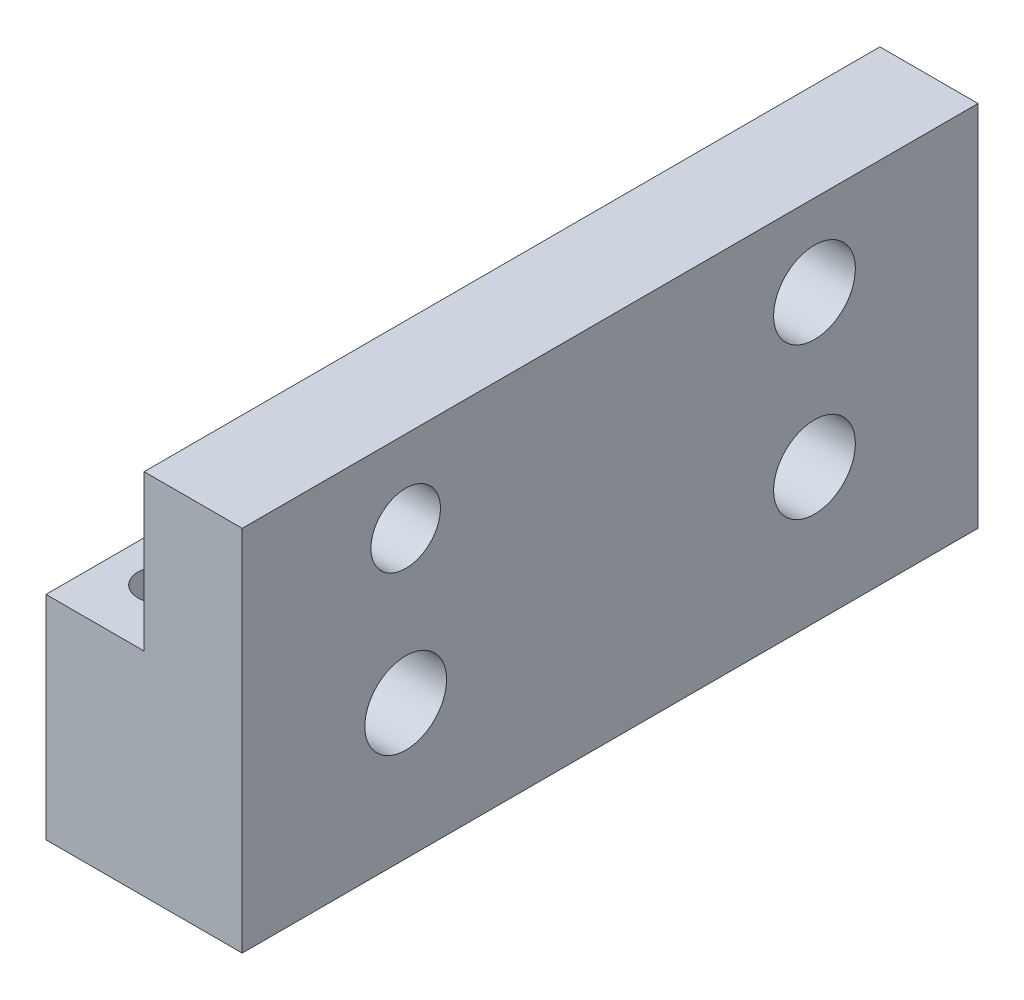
ISO-10303-21;
HEADER;
FILE_DESCRIPTION(('STEP AP214'),'2;1');
FILE_NAME('part.step','',(''),(''),'','','');
FILE_SCHEMA(('AUTOMOTIVE_DESIGN { 1 0 10303 214 1 1 1 1 }'));
ENDSEC;
DATA;
#1=APPLICATION_CONTEXT('core data for automotive mechanical design processes');
#2=APPLICATION_PROTOCOL_DEFINITION('international standard','automotive_design',2000,#1);
#3=PRODUCT_CONTEXT('',#1,'mechanical');
#4=PRODUCT('Part','Part','',(#3));
#5=PRODUCT_RELATED_PRODUCT_CATEGORY('part','',(#4));
#6=PRODUCT_DEFINITION_FORMATION('','',#4);
#7=PRODUCT_DEFINITION_CONTEXT('part definition',#1,'design');
#8=PRODUCT_DEFINITION('design','',#6,#7);
#9=PRODUCT_DEFINITION_SHAPE('','',#8);
#10=(LENGTH_UNIT() NAMED_UNIT(*) SI_UNIT(.MILLI.,.METRE.));
#11=(NAMED_UNIT(*) PLANE_ANGLE_UNIT() SI_UNIT($,.RADIAN.));
#12=(NAMED_UNIT(*) SI_UNIT($,.STERADIAN.) SOLID_ANGLE_UNIT());
#13=UNCERTAINTY_MEASURE_WITH_UNIT(LENGTH_MEASURE(1.E-05),#10,'distance_accuracy_value','');
#14=(GEOMETRIC_REPRESENTATION_CONTEXT(3) GLOBAL_UNCERTAINTY_ASSIGNED_CONTEXT((#13)) GLOBAL_UNIT_ASSIGNED_CONTEXT((#10,
#11,#12)) REPRESENTATION_CONTEXT('',''));
#15=CARTESIAN_POINT('',(0.,0.,0.));
#16=DIRECTION('',(0.,0.,1.));
#17=DIRECTION('',(1.,0.,0.));
#18=AXIS2_PLACEMENT_3D('',#15,#16,#17);
#19=CARTESIAN_POINT('',(-6.,3.5,20.));
#20=DIRECTION('',(0.,1.,0.));
#21=DIRECTION('',(0.,0.,1.));
#22=AXIS2_PLACEMENT_3D('',#19,#20,#21);
#23=CYLINDRICAL_SURFACE('',#22,1.64999999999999);
#24=CARTESIAN_POINT('',(-6.,3.5,20.));
#25=DIRECTION('',(0.,1.,0.));
#26=DIRECTION('',(0.,0.,1.));
#27=AXIS2_PLACEMENT_3D('',#24,#25,#26);
#28=CIRCLE('',#27,1.64999999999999);
#29=CARTESIAN_POINT('',(-6.,3.5,21.65));
#30=VERTEX_POINT('',#29);
#31=EDGE_CURVE('E169',#30,#30,#28,.T.);
#32=ORIENTED_EDGE('',*,*,#31,.T.);
#33=EDGE_LOOP('',(#32));
#34=FACE_BOUND('',#33,.T.);
#35=CARTESIAN_POINT('',(-4.35000000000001,-1.00000000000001,20.));
#36=CARTESIAN_POINT('',(-4.35000378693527,-1.00000272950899,20.0900197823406));
#37=CARTESIAN_POINT('',(-4.35739630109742,-1.00245575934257,20.1800846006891));
#38=CARTESIAN_POINT('',(-4.38670360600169,-1.01201043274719,20.3576091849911));
#39=CARTESIAN_POINT('',(-4.40863108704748,-1.01911613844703,20.4450666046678));
#40=CARTESIAN_POINT('',(-4.46617396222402,-1.03720026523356,20.614724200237));
#41=CARTESIAN_POINT('',(-4.50176272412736,-1.04817114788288,20.696934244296));
#42=CARTESIAN_POINT('',(-4.58551147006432,-1.07286273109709,20.8542035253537));
#43=CARTESIAN_POINT('',(-4.63367179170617,-1.08658350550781,20.9292625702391));
#44=CARTESIAN_POINT('',(-4.74291936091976,-1.1158519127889,21.0726698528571));
#45=CARTESIAN_POINT('',(-4.80435762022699,-1.13144265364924,21.1407418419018));
#46=CARTESIAN_POINT('',(-4.93768628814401,-1.16245793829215,21.2658396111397));
#47=CARTESIAN_POINT('',(-5.00958092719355,-1.17788241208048,21.3228608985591));
#48=CARTESIAN_POINT('',(-5.16426535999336,-1.20729396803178,21.4258059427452));
#49=CARTESIAN_POINT('',(-5.24730704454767,-1.22122763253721,21.4713675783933));
#50=CARTESIAN_POINT('',(-5.42035974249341,-1.24540403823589,21.5477197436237));
#51=CARTESIAN_POINT('',(-5.51036197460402,-1.25565134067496,21.5785285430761));
#52=CARTESIAN_POINT('',(-5.66730933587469,-1.2688275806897,21.6174939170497));
#53=CARTESIAN_POINT('',(-5.73317964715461,-1.27302550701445,21.6296582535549));
#54=CARTESIAN_POINT('',(-5.86602497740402,-1.27866051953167,21.6459123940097));
#55=CARTESIAN_POINT('',(-5.9329998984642,-1.28009784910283,21.6500029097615));
#56=CARTESIAN_POINT('',(-6.08986951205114,-1.28009197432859,21.6499960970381));
#57=CARTESIAN_POINT('',(-6.17978432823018,-1.27749808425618,21.6426273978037));
#58=CARTESIAN_POINT('',(-6.35699665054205,-1.26744328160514,21.6134233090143));
#59=CARTESIAN_POINT('',(-6.44429168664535,-1.25997791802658,21.5915746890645));
#60=CARTESIAN_POINT('',(-6.61360460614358,-1.24111979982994,21.5342620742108));
#61=CARTESIAN_POINT('',(-6.69563371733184,-1.22973575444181,21.4988282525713));
#62=CARTESIAN_POINT('',(-6.85259401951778,-1.20433464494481,21.4154453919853));
#63=CARTESIAN_POINT('',(-6.92752482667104,-1.19031743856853,21.3674956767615));
#64=CARTESIAN_POINT('',(-7.07105050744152,-1.1606257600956,21.2584719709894));
#65=CARTESIAN_POINT('',(-7.13933433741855,-1.14491060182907,21.1969994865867));
#66=CARTESIAN_POINT('',(-7.26484842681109,-1.11393470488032,21.0635104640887));
#67=CARTESIAN_POINT('',(-7.32207483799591,-1.0986741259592,20.9914902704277));
#68=CARTESIAN_POINT('',(-7.42525766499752,-1.06985426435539,20.8366699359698));
#69=CARTESIAN_POINT('',(-7.47088388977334,-1.05634926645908,20.7536389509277));
#70=CARTESIAN_POINT('',(-7.54735861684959,-1.03306105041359,20.5806069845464));
#71=CARTESIAN_POINT('',(-7.57822470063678,-1.02327340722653,20.4906144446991));
#72=CARTESIAN_POINT('',(-7.61733057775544,-1.01070811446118,20.3335211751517));
#73=CARTESIAN_POINT('',(-7.62955663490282,-1.00671495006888,20.2674828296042));
#74=CARTESIAN_POINT('',(-7.6458924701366,-1.0013599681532,20.1343046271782));
#75=CARTESIAN_POINT('',(-7.65000282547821,-0.999997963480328,20.0671648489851));
#76=CARTESIAN_POINT('',(-7.64999621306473,-1.00000272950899,19.9099802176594));
#77=CARTESIAN_POINT('',(-7.64260369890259,-1.00245575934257,19.8199153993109));
#78=CARTESIAN_POINT('',(-7.61329639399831,-1.01201043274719,19.6423908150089));
#79=CARTESIAN_POINT('',(-7.59136891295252,-1.01911613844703,19.5549333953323));
#80=CARTESIAN_POINT('',(-7.53382603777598,-1.03720026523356,19.385275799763));
#81=CARTESIAN_POINT('',(-7.49823727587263,-1.04817114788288,19.303065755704));
#82=CARTESIAN_POINT('',(-7.41448852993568,-1.07286273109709,19.1457964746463));
#83=CARTESIAN_POINT('',(-7.36632820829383,-1.08658350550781,19.0707374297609));
#84=CARTESIAN_POINT('',(-7.25708063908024,-1.1158519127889,18.9273301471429));
#85=CARTESIAN_POINT('',(-7.19564237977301,-1.13144265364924,18.8592581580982));
#86=CARTESIAN_POINT('',(-7.06231371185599,-1.16245793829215,18.7341603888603));
#87=CARTESIAN_POINT('',(-6.99041907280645,-1.17788241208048,18.6771391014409));
#88=CARTESIAN_POINT('',(-6.83573464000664,-1.20729396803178,18.5741940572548));
#89=CARTESIAN_POINT('',(-6.75269295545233,-1.22122763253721,18.5286324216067));
#90=CARTESIAN_POINT('',(-6.57964025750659,-1.24540403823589,18.4522802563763));
#91=CARTESIAN_POINT('',(-6.48963802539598,-1.25565134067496,18.4214714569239));
#92=CARTESIAN_POINT('',(-6.33269066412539,-1.26882758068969,18.3825060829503));
#93=CARTESIAN_POINT('',(-6.26682035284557,-1.27302550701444,18.3703417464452));
#94=CARTESIAN_POINT('',(-6.13397502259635,-1.27866051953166,18.3540876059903));
#95=CARTESIAN_POINT('',(-6.06700010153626,-1.28009784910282,18.3499970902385));
#96=CARTESIAN_POINT('',(-5.91013048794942,-1.2800919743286,18.3500039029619));
#97=CARTESIAN_POINT('',(-5.82021567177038,-1.2774980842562,18.3573726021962));
#98=CARTESIAN_POINT('',(-5.64300334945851,-1.26744328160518,18.3865766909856));
#99=CARTESIAN_POINT('',(-5.5557083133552,-1.25997791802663,18.4084253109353));
#100=CARTESIAN_POINT('',(-5.38639539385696,-1.24111979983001,18.465737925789));
#101=CARTESIAN_POINT('',(-5.30436628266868,-1.22973575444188,18.5011717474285));
#102=CARTESIAN_POINT('',(-5.14740598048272,-1.2043346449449,18.5845546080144));
#103=CARTESIAN_POINT('',(-5.07247517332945,-1.19031743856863,18.6325043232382));
#104=CARTESIAN_POINT('',(-4.92894949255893,-1.1606257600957,18.7415280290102));
#105=CARTESIAN_POINT('',(-4.86066566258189,-1.14491060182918,18.8030005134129));
#106=CARTESIAN_POINT('',(-4.7351515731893,-1.11393470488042,18.9364895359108));
#107=CARTESIAN_POINT('',(-4.67792516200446,-1.0986741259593,19.0085097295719));
#108=CARTESIAN_POINT('',(-4.5747423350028,-1.06985426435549,19.1633300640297));
#109=CARTESIAN_POINT('',(-4.52911611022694,-1.05634926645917,19.2463610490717));
#110=CARTESIAN_POINT('',(-4.45264138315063,-1.03306105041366,19.419393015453));
#111=CARTESIAN_POINT('',(-4.4217752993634,-1.02327340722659,19.5093855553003));
#112=CARTESIAN_POINT('',(-4.38266942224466,-1.01070811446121,19.6664788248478));
#113=CARTESIAN_POINT('',(-4.37044336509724,-1.0067149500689,19.7325171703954));
#114=CARTESIAN_POINT('',(-4.35410752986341,-1.0013599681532,19.8656953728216));
#115=CARTESIAN_POINT('',(-4.34999717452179,-0.999997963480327,19.9328351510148));
#116=CARTESIAN_POINT('',(-4.35000000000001,-1.00000000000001,20.));
#117=B_SPLINE_CURVE_WITH_KNOTS('',3,(#35,#36,#37,#38,#39,#40,#41,#42,#43,#44,#45,#46,#47,#48,
#49,#50,#51,#52,#53,#54,#55,#56,#57,#58,#59,#60,#61,#62,#63,#64,#65,#66,#67,#68,#69,#70,#71,#72,
#73,#74,#75,#76,#77,#78,#79,#80,#81,#82,#83,#84,#85,#86,#87,#88,#89,#90,#91,#92,#93,#94,#95,#96,
#97,#98,#99,#100,#101,#102,#103,#104,#105,#106,#107,#108,#109,#110,#111,#112,#113,#114,#115,
#116),.UNSPECIFIED.,.T.,.F.,(4,2,2,2,2,2,2,2,2,2,2,2,2,2,2,2,2,2,2,2,2,2,2,2,2,2,2,2,2,2,2,2,2,
2,2,2,2,2,2,2,4),(0.,0.269807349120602,0.539850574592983,0.809370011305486,1.07889668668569,
1.35668555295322,1.63458712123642,1.92039970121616,2.20585741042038,2.40668679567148,
2.6074984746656,2.87685400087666,3.14645597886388,3.41546259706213,3.68448375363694,
3.96286239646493,4.24133774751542,4.52702385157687,4.81236880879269,5.01368965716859,
5.21499618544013,5.48480353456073,5.75484676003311,6.02436619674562,6.29389287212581,
6.57168173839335,6.84958330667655,7.13539588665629,7.42085359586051,7.62168298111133,
7.82249466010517,8.09185018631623,8.36145216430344,8.63045878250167,8.89947993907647,
9.17785858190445,9.45633393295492,9.74202003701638,10.0273649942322,10.2286858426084,
10.4299923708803),.UNSPECIFIED.);
#118=CARTESIAN_POINT('',(-4.35000000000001,-1.00000000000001,20.));
#119=VERTEX_POINT('',#118);
#120=EDGE_CURVE('E157',#119,#119,#117,.T.);
#121=ORIENTED_EDGE('',*,*,#120,.T.);
#122=EDGE_LOOP('',(#121));
#123=FACE_BOUND('',#122,.T.);
#124=ADVANCED_FACE('F17',(#34,#123),#23,.F.);
#125=CARTESIAN_POINT('',(-6.,3.5,70.));
#126=DIRECTION('',(0.,1.,0.));
#127=DIRECTION('',(0.,0.,1.));
#128=AXIS2_PLACEMENT_3D('',#125,#126,#127);
#129=CYLINDRICAL_SURFACE('',#128,1.64999999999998);
#130=CARTESIAN_POINT('',(-6.,3.5,70.));
#131=DIRECTION('',(0.,1.,0.));
#132=DIRECTION('',(0.,0.,1.));
#133=AXIS2_PLACEMENT_3D('',#130,#131,#132);
#134=CIRCLE('',#133,1.64999999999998);
#135=CARTESIAN_POINT('',(-6.,3.5,71.65));
#136=VERTEX_POINT('',#135);
#137=EDGE_CURVE('E105',#136,#136,#134,.T.);
#138=ORIENTED_EDGE('',*,*,#137,.T.);
#139=EDGE_LOOP('',(#138));
#140=FACE_BOUND('',#139,.T.);
#141=CARTESIAN_POINT('',(-4.35000000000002,-1.,70.));
#142=CARTESIAN_POINT('',(-4.35000378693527,-1.00000272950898,70.0900197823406));
#143=CARTESIAN_POINT('',(-4.35739630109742,-1.00245575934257,70.1800846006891));
#144=CARTESIAN_POINT('',(-4.3867036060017,-1.01201043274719,70.3576091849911));
#145=CARTESIAN_POINT('',(-4.40863108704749,-1.01911613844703,70.4450666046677));
#146=CARTESIAN_POINT('',(-4.46617396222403,-1.03720026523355,70.614724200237));
#147=CARTESIAN_POINT('',(-4.50176272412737,-1.04817114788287,70.696934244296));
#148=CARTESIAN_POINT('',(-4.58551147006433,-1.07286273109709,70.8542035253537));
#149=CARTESIAN_POINT('',(-4.63367179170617,-1.08658350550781,70.9292625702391));
#150=CARTESIAN_POINT('',(-4.74291936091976,-1.1158519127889,71.0726698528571));
#151=CARTESIAN_POINT('',(-4.80435762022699,-1.13144265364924,71.1407418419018));
#152=CARTESIAN_POINT('',(-4.93768628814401,-1.16245793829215,71.2658396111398));
#153=CARTESIAN_POINT('',(-5.00958092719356,-1.17788241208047,71.3228608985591));
#154=CARTESIAN_POINT('',(-5.16426535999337,-1.20729396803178,71.4258059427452));
#155=CARTESIAN_POINT('',(-5.24730704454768,-1.22122763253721,71.4713675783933));
#156=CARTESIAN_POINT('',(-5.42035974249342,-1.24540403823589,71.5477197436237));
#157=CARTESIAN_POINT('',(-5.51036197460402,-1.25565134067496,71.5785285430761));
#158=CARTESIAN_POINT('',(-5.66730933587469,-1.2688275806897,71.6174939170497));
#159=CARTESIAN_POINT('',(-5.73317964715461,-1.27302550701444,71.6296582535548));
#160=CARTESIAN_POINT('',(-5.86602497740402,-1.27866051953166,71.6459123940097));
#161=CARTESIAN_POINT('',(-5.9329998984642,-1.28009784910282,71.6500029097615));
#162=CARTESIAN_POINT('',(-6.08986951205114,-1.28009197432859,71.649996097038));
#163=CARTESIAN_POINT('',(-6.17978432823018,-1.27749808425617,71.6426273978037));
#164=CARTESIAN_POINT('',(-6.35699665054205,-1.26744328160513,71.6134233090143));
#165=CARTESIAN_POINT('',(-6.44429168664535,-1.25997791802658,71.5915746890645));
#166=CARTESIAN_POINT('',(-6.61360460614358,-1.24111979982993,71.5342620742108));
#167=CARTESIAN_POINT('',(-6.69563371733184,-1.2297357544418,71.4988282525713));
#168=CARTESIAN_POINT('',(-6.85259401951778,-1.2043346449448,71.4154453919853));
#169=CARTESIAN_POINT('',(-6.92752482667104,-1.19031743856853,71.3674956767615));
#170=CARTESIAN_POINT('',(-7.07105050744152,-1.16062576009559,71.2584719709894));
#171=CARTESIAN_POINT('',(-7.13933433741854,-1.14491060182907,71.1969994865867));
#172=CARTESIAN_POINT('',(-7.26484842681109,-1.11393470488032,71.0635104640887));
#173=CARTESIAN_POINT('',(-7.32207483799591,-1.09867412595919,70.9914902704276));
#174=CARTESIAN_POINT('',(-7.42525766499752,-1.06985426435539,70.8366699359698));
#175=CARTESIAN_POINT('',(-7.47088388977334,-1.05634926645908,70.7536389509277));
#176=CARTESIAN_POINT('',(-7.54735861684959,-1.03306105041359,70.5806069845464));
#177=CARTESIAN_POINT('',(-7.57822470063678,-1.02327340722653,70.4906144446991));
#178=CARTESIAN_POINT('',(-7.61733057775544,-1.01070811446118,70.3335211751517));
#179=CARTESIAN_POINT('',(-7.62955663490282,-1.00671495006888,70.2674828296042));
#180=CARTESIAN_POINT('',(-7.6458924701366,-1.0013599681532,70.1343046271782));
#181=CARTESIAN_POINT('',(-7.65000282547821,-0.999997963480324,70.0671648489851));
#182=CARTESIAN_POINT('',(-7.64999621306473,-1.00000272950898,69.9099802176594));
#183=CARTESIAN_POINT('',(-7.64260369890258,-1.00245575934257,69.8199153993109));
#184=CARTESIAN_POINT('',(-7.61329639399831,-1.01201043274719,69.6423908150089));
#185=CARTESIAN_POINT('',(-7.59136891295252,-1.01911613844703,69.5549333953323));
#186=CARTESIAN_POINT('',(-7.53382603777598,-1.03720026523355,69.385275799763));
#187=CARTESIAN_POINT('',(-7.49823727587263,-1.04817114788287,69.303065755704));
#188=CARTESIAN_POINT('',(-7.41448852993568,-1.07286273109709,69.1457964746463));
#189=CARTESIAN_POINT('',(-7.36632820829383,-1.08658350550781,69.0707374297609));
#190=CARTESIAN_POINT('',(-7.25708063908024,-1.1158519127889,68.9273301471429));
#191=CARTESIAN_POINT('',(-7.19564237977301,-1.13144265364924,68.8592581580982));
#192=CARTESIAN_POINT('',(-7.06231371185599,-1.16245793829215,68.7341603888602));
#193=CARTESIAN_POINT('',(-6.99041907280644,-1.17788241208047,68.6771391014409));
#194=CARTESIAN_POINT('',(-6.83573464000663,-1.20729396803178,68.5741940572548));
#195=CARTESIAN_POINT('',(-6.75269295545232,-1.22122763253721,68.5286324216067));
#196=CARTESIAN_POINT('',(-6.57964025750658,-1.24540403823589,68.4522802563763));
#197=CARTESIAN_POINT('',(-6.48963802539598,-1.25565134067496,68.4214714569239));
#198=CARTESIAN_POINT('',(-6.3326906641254,-1.26882758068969,68.3825060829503));
#199=CARTESIAN_POINT('',(-6.26682035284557,-1.27302550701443,68.3703417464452));
#200=CARTESIAN_POINT('',(-6.13397502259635,-1.27866051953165,68.3540876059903));
#201=CARTESIAN_POINT('',(-6.06700010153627,-1.28009784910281,68.3499970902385));
#202=CARTESIAN_POINT('',(-5.91013048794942,-1.2800919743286,68.3500039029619));
#203=CARTESIAN_POINT('',(-5.82021567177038,-1.27749808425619,68.3573726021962));
#204=CARTESIAN_POINT('',(-5.64300334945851,-1.26744328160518,68.3865766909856));
#205=CARTESIAN_POINT('',(-5.5557083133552,-1.25997791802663,68.4084253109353));
#206=CARTESIAN_POINT('',(-5.38639539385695,-1.24111979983,68.465737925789));
#207=CARTESIAN_POINT('',(-5.30436628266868,-1.22973575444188,68.5011717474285));
#208=CARTESIAN_POINT('',(-5.14740598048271,-1.20433464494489,68.5845546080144));
#209=CARTESIAN_POINT('',(-5.07247517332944,-1.19031743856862,68.6325043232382));
#210=CARTESIAN_POINT('',(-4.92894949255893,-1.16062576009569,68.7415280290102));
#211=CARTESIAN_POINT('',(-4.86066566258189,-1.14491060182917,68.8030005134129));
#212=CARTESIAN_POINT('',(-4.73515157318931,-1.11393470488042,68.9364895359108));
#213=CARTESIAN_POINT('',(-4.67792516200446,-1.09867412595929,69.0085097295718));
#214=CARTESIAN_POINT('',(-4.5747423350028,-1.06985426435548,69.1633300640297));
#215=CARTESIAN_POINT('',(-4.52911611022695,-1.05634926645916,69.2463610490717));
#216=CARTESIAN_POINT('',(-4.45264138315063,-1.03306105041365,69.419393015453));
#217=CARTESIAN_POINT('',(-4.4217752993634,-1.02327340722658,69.5093855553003));
#218=CARTESIAN_POINT('',(-4.38266942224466,-1.01070811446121,69.6664788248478));
#219=CARTESIAN_POINT('',(-4.37044336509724,-1.0067149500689,69.7325171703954));
#220=CARTESIAN_POINT('',(-4.35410752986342,-1.0013599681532,69.8656953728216));
#221=CARTESIAN_POINT('',(-4.34999717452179,-0.999997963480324,69.9328351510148));
#222=CARTESIAN_POINT('',(-4.35000000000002,-1.,70.));
#223=B_SPLINE_CURVE_WITH_KNOTS('',3,(#141,#142,#143,#144,#145,#146,#147,#148,#149,#150,#151,
#152,#153,#154,#155,#156,#157,#158,#159,#160,#161,#162,#163,#164,#165,#166,#167,#168,#169,#170,
#171,#172,#173,#174,#175,#176,#177,#178,#179,#180,#181,#182,#183,#184,#185,#186,#187,#188,#189,
#190,#191,#192,#193,#194,#195,#196,#197,#198,#199,#200,#201,#202,#203,#204,#205,#206,#207,#208,
#209,#210,#211,#212,#213,#214,#215,#216,#217,#218,#219,#220,#221,#222),.UNSPECIFIED.,.T.,.F.,(4,
2,2,2,2,2,2,2,2,2,2,2,2,2,2,2,2,2,2,2,2,2,2,2,2,2,2,2,2,2,2,2,2,2,2,2,2,2,2,2,4),(0.,
0.269807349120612,0.539850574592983,0.80937001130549,1.07889668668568,1.35668555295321,
1.63458712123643,1.92039970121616,2.20585741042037,2.40668679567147,2.60749847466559,
2.87685400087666,3.14645597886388,3.41546259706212,3.68448375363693,3.96286239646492,
4.2413377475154,4.52702385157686,4.81236880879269,5.01368965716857,5.21499618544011,
5.48480353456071,5.7548467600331,6.0243661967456,6.2938928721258,6.57168173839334,
6.84958330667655,7.13539588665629,7.42085359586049,7.62168298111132,7.82249466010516,
8.09185018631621,8.36145216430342,8.63045878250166,8.89947993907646,9.17785858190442,
9.4563339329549,9.74202003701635,10.0273649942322,10.2286858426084,10.4299923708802),.UNSPECIFIED.);
#224=CARTESIAN_POINT('',(-4.35000000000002,-1.,70.));
#225=VERTEX_POINT('',#224);
#226=EDGE_CURVE('E131',#225,#225,#223,.T.);
#227=ORIENTED_EDGE('',*,*,#226,.T.);
#228=EDGE_LOOP('',(#227));
#229=FACE_BOUND('',#228,.T.);
#230=ADVANCED_FACE('F139',(#140,#229),#129,.F.);
#231=CARTESIAN_POINT('',(-5.99999999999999,-22.5,82.));
#232=DIRECTION('',(0.,1.,0.));
#233=DIRECTION('',(0.,0.,1.));
#234=AXIS2_PLACEMENT_3D('',#231,#232,#233);
#235=CYLINDRICAL_SURFACE('',#234,2.75);
#236=CARTESIAN_POINT('',(-5.99999999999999,-22.5,82.));
#237=DIRECTION('',(0.,1.,0.));
#238=DIRECTION('',(0.,0.,1.));
#239=AXIS2_PLACEMENT_3D('',#236,#237,#238);
#240=CIRCLE('',#239,2.75);
#241=CARTESIAN_POINT('',(-5.99999999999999,-22.5,84.75));
#242=VERTEX_POINT('',#241);
#243=EDGE_CURVE('E125',#242,#242,#240,.F.);
#244=ORIENTED_EDGE('',*,*,#243,.T.);
#245=EDGE_LOOP('',(#244));
#246=FACE_BOUND('',#245,.T.);
#247=CARTESIAN_POINT('',(-5.99999999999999,3.5,82.));
#248=DIRECTION('',(0.,1.,0.));
#249=DIRECTION('',(0.,0.,1.));
#250=AXIS2_PLACEMENT_3D('',#247,#248,#249);
#251=CIRCLE('',#250,2.75);
#252=CARTESIAN_POINT('',(-5.99999999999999,3.5,84.75));
#253=VERTEX_POINT('',#252);
#254=EDGE_CURVE('E21',#253,#253,#251,.T.);
#255=ORIENTED_EDGE('',*,*,#254,.T.);
#256=EDGE_LOOP('',(#255));
#257=FACE_BOUND('',#256,.T.);
#258=ADVANCED_FACE('F181',(#246,#257),#235,.F.);
#259=CARTESIAN_POINT('',(-6.,-22.5,45.));
#260=DIRECTION('',(0.,1.,0.));
#261=DIRECTION('',(0.,0.,1.));
#262=AXIS2_PLACEMENT_3D('',#259,#260,#261);
#263=CYLINDRICAL_SURFACE('',#262,2.75);
#264=CARTESIAN_POINT('',(-6.,-22.5,45.));
#265=DIRECTION('',(0.,1.,0.));
#266=DIRECTION('',(0.,0.,1.));
#267=AXIS2_PLACEMENT_3D('',#264,#265,#266);
#268=CIRCLE('',#267,2.75);
#269=CARTESIAN_POINT('',(-6.,-22.5,47.75));
#270=VERTEX_POINT('',#269);
#271=EDGE_CURVE('E122',#270,#270,#268,.F.);
#272=ORIENTED_EDGE('',*,*,#271,.T.);
#273=EDGE_LOOP('',(#272));
#274=FACE_BOUND('',#273,.T.);
#275=CARTESIAN_POINT('',(-6.,3.5,45.));
#276=DIRECTION('',(0.,1.,0.));
#277=DIRECTION('',(0.,0.,1.));
#278=AXIS2_PLACEMENT_3D('',#275,#276,#277);
#279=CIRCLE('',#278,2.75);
#280=CARTESIAN_POINT('',(-6.,3.5,47.75));
#281=VERTEX_POINT('',#280);
#282=EDGE_CURVE('E174',#281,#281,#279,.T.);
#283=ORIENTED_EDGE('',*,*,#282,.T.);
#284=EDGE_LOOP('',(#283));
#285=FACE_BOUND('',#284,.T.);
#286=ADVANCED_FACE('F227',(#274,#285),#263,.F.);
#287=CARTESIAN_POINT('',(-6.,-22.5,8.));
#288=DIRECTION('',(0.,1.,0.));
#289=DIRECTION('',(0.,0.,1.));
#290=AXIS2_PLACEMENT_3D('',#287,#288,#289);
#291=CYLINDRICAL_SURFACE('',#290,2.75);
#292=CARTESIAN_POINT('',(-6.,-22.5,8.));
#293=DIRECTION('',(0.,1.,0.));
#294=DIRECTION('',(0.,0.,1.));
#295=AXIS2_PLACEMENT_3D('',#292,#293,#294);
#296=CIRCLE('',#295,2.75);
#297=CARTESIAN_POINT('',(-6.,-22.5,10.75));
#298=VERTEX_POINT('',#297);
#299=EDGE_CURVE('E102',#298,#298,#296,.F.);
#300=ORIENTED_EDGE('',*,*,#299,.T.);
#301=EDGE_LOOP('',(#300));
#302=FACE_BOUND('',#301,.T.);
#303=CARTESIAN_POINT('',(-6.,3.5,8.));
#304=DIRECTION('',(0.,1.,0.));
#305=DIRECTION('',(0.,0.,1.));
#306=AXIS2_PLACEMENT_3D('',#303,#304,#305);
#307=CIRCLE('',#306,2.75);
#308=CARTESIAN_POINT('',(-6.,3.5,10.75));
#309=VERTEX_POINT('',#308);
#310=EDGE_CURVE('E172',#309,#309,#307,.T.);
#311=ORIENTED_EDGE('',*,*,#310,.T.);
#312=EDGE_LOOP('',(#311));
#313=FACE_BOUND('',#312,.T.);
#314=ADVANCED_FACE('F232',(#302,#313),#291,.F.);
#315=CARTESIAN_POINT('',(-12.,22.5,90.));
#316=DIRECTION('',(1.,0.,0.));
#317=DIRECTION('',(0.,1.,0.));
#318=AXIS2_PLACEMENT_3D('',#315,#316,#317);
#319=PLANE('',#318);
#320=DIRECTION('',(0.,0.,-1.));
#321=VECTOR('',#320,1.);
#322=CARTESIAN_POINT('',(-12.,3.5,0.));
#323=LINE('',#322,#321);
#324=CARTESIAN_POINT('',(-12.,3.5,90.));
#325=VERTEX_POINT('',#324);
#326=CARTESIAN_POINT('',(-12.,3.5,0.));
#327=VERTEX_POINT('',#326);
#328=EDGE_CURVE('E69',#325,#327,#323,.T.);
#329=ORIENTED_EDGE('',*,*,#328,.T.);
#330=DIRECTION('',(0.,1.,0.));
#331=VECTOR('',#330,1.);
#332=CARTESIAN_POINT('',(-12.,0.,0.));
#333=LINE('',#332,#331);
#334=CARTESIAN_POINT('',(-12.,-22.5,0.));
#335=VERTEX_POINT('',#334);
#336=EDGE_CURVE('E408',#327,#335,#333,.F.);
#337=ORIENTED_EDGE('',*,*,#336,.T.);
#338=DIRECTION('',(0.,0.,1.));
#339=VECTOR('',#338,1.);
#340=CARTESIAN_POINT('',(-12.,-22.5,90.));
#341=LINE('',#340,#339);
#342=CARTESIAN_POINT('',(-12.,-22.5,90.));
#343=VERTEX_POINT('',#342);
#344=EDGE_CURVE('E83',#335,#343,#341,.T.);
#345=ORIENTED_EDGE('',*,*,#344,.T.);
#346=DIRECTION('',(0.,1.,0.));
#347=VECTOR('',#346,1.);
#348=CARTESIAN_POINT('',(-12.,0.,90.));
#349=LINE('',#348,#347);
#350=EDGE_CURVE('E95',#325,#343,#349,.F.);
#351=ORIENTED_EDGE('',*,*,#350,.F.);
#352=EDGE_LOOP('',(#329,#337,#345,#351));
#353=FACE_BOUND('',#352,.T.);
#354=CARTESIAN_POINT('',(-12.,-6.00000000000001,70.));
#355=DIRECTION('',(1.,0.,0.));
#356=DIRECTION('',(0.,1.,0.));
#357=AXIS2_PLACEMENT_3D('',#354,#355,#356);
#358=CIRCLE('',#357,5.);
#359=CARTESIAN_POINT('',(-12.,-1.00000000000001,70.));
#360=VERTEX_POINT('',#359);
#361=EDGE_CURVE('E128',#360,#360,#358,.T.);
#362=ORIENTED_EDGE('',*,*,#361,.T.);
#363=EDGE_LOOP('',(#362));
#364=FACE_BOUND('',#363,.T.);
#365=CARTESIAN_POINT('',(-12.,-6.00000000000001,20.));
#366=DIRECTION('',(1.,0.,0.));
#367=DIRECTION('',(0.,1.,0.));
#368=AXIS2_PLACEMENT_3D('',#365,#366,#367);
#369=CIRCLE('',#368,5.);
#370=CARTESIAN_POINT('',(-12.,-1.00000000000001,20.));
#371=VERTEX_POINT('',#370);
#372=EDGE_CURVE('E137',#371,#371,#369,.T.);
#373=ORIENTED_EDGE('',*,*,#372,.T.);
#374=EDGE_LOOP('',(#373));
#375=FACE_BOUND('',#374,.T.);
#376=ADVANCED_FACE('F192',(#353,#364,#375),#319,.F.);
#377=CARTESIAN_POINT('',(0.,22.5,0.));
#378=DIRECTION('',(1.,0.,0.));
#379=DIRECTION('',(0.,1.,0.));
#380=AXIS2_PLACEMENT_3D('',#377,#378,#379);
#381=PLANE('',#380);
#382=DIRECTION('',(0.,0.,-1.));
#383=VECTOR('',#382,1.);
#384=CARTESIAN_POINT('',(0.,22.5,90.));
#385=LINE('',#384,#383);
#386=CARTESIAN_POINT('',(0.,22.5,90.));
#387=VERTEX_POINT('',#386);
#388=CARTESIAN_POINT('',(0.,22.5,0.));
#389=VERTEX_POINT('',#388);
#390=EDGE_CURVE('E418',#387,#389,#385,.T.);
#391=ORIENTED_EDGE('',*,*,#390,.T.);
#392=DIRECTION('',(0.,1.,0.));
#393=VECTOR('',#392,1.);
#394=CARTESIAN_POINT('',(0.,0.,0.));
#395=LINE('',#394,#393);
#396=CARTESIAN_POINT('',(0.,3.5,0.));
#397=VERTEX_POINT('',#396);
#398=EDGE_CURVE('E89',#389,#397,#395,.F.);
#399=ORIENTED_EDGE('',*,*,#398,.T.);
#400=DIRECTION('',(0.,0.,-1.));
#401=VECTOR('',#400,1.);
#402=CARTESIAN_POINT('',(0.,3.5,0.));
#403=LINE('',#402,#401);
#404=CARTESIAN_POINT('',(0.,3.5,90.));
#405=VERTEX_POINT('',#404);
#406=EDGE_CURVE('E86',#397,#405,#403,.F.);
#407=ORIENTED_EDGE('',*,*,#406,.T.);
#408=DIRECTION('',(0.,1.,0.));
#409=VECTOR('',#408,1.);
#410=CARTESIAN_POINT('',(0.,0.,90.));
#411=LINE('',#410,#409);
#412=EDGE_CURVE('E74',#387,#405,#411,.F.);
#413=ORIENTED_EDGE('',*,*,#412,.F.);
#414=EDGE_LOOP('',(#391,#399,#407,#413));
#415=FACE_BOUND('',#414,.T.);
#416=CARTESIAN_POINT('',(0.,12.5,20.));
#417=DIRECTION('',(-1.,0.,0.));
#418=DIRECTION('',(0.,-1.,0.));
#419=AXIS2_PLACEMENT_3D('',#416,#417,#418);
#420=CIRCLE('',#419,5.);
#421=CARTESIAN_POINT('',(0.,7.49999999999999,20.));
#422=VERTEX_POINT('',#421);
#423=EDGE_CURVE('E162',#422,#422,#420,.F.);
#424=ORIENTED_EDGE('',*,*,#423,.T.);
#425=EDGE_LOOP('',(#424));
#426=FACE_BOUND('',#425,.T.);
#427=CARTESIAN_POINT('',(0.,12.5,70.));
#428=DIRECTION('',(-1.,0.,0.));
#429=DIRECTION('',(0.,0.,1.));
#430=AXIS2_PLACEMENT_3D('',#427,#428,#429);
#431=CIRCLE('',#430,4.24999999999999);
#432=CARTESIAN_POINT('',(0.,12.5,74.25));
#433=VERTEX_POINT('',#432);
#434=EDGE_CURVE('E91',#433,#433,#431,.F.);
#435=ORIENTED_EDGE('',*,*,#434,.T.);
#436=EDGE_LOOP('',(#435));
#437=FACE_BOUND('',#436,.T.);
#438=ADVANCED_FACE('F87',(#415,#426,#437),#381,.F.);
#439=CARTESIAN_POINT('',(-12.,3.5,0.));
#440=DIRECTION('',(0.,-1.,0.));
#441=DIRECTION('',(0.,0.,-1.));
#442=AXIS2_PLACEMENT_3D('',#439,#440,#441);
#443=PLANE('',#442);
#444=ORIENTED_EDGE('',*,*,#406,.F.);
#445=DIRECTION('',(1.,0.,0.));
#446=VECTOR('',#445,1.);
#447=CARTESIAN_POINT('',(0.,3.5,0.));
#448=LINE('',#447,#446);
#449=EDGE_CURVE('E119',#397,#327,#448,.F.);
#450=ORIENTED_EDGE('',*,*,#449,.T.);
#451=ORIENTED_EDGE('',*,*,#328,.F.);
#452=DIRECTION('',(1.,0.,0.));
#453=VECTOR('',#452,1.);
#454=CARTESIAN_POINT('',(0.,3.5,90.));
#455=LINE('',#454,#453);
#456=EDGE_CURVE('E78',#405,#325,#455,.F.);
#457=ORIENTED_EDGE('',*,*,#456,.F.);
#458=EDGE_LOOP('',(#444,#450,#451,#457));
#459=FACE_BOUND('',#458,.T.);
#460=ORIENTED_EDGE('',*,*,#137,.F.);
#461=EDGE_LOOP('',(#460));
#462=FACE_BOUND('',#461,.T.);
#463=ORIENTED_EDGE('',*,*,#31,.F.);
#464=EDGE_LOOP('',(#463));
#465=FACE_BOUND('',#464,.T.);
#466=ORIENTED_EDGE('',*,*,#310,.F.);
#467=EDGE_LOOP('',(#466));
#468=FACE_BOUND('',#467,.T.);
#469=ORIENTED_EDGE('',*,*,#282,.F.);
#470=EDGE_LOOP('',(#469));
#471=FACE_BOUND('',#470,.T.);
#472=ORIENTED_EDGE('',*,*,#254,.F.);
#473=EDGE_LOOP('',(#472));
#474=FACE_BOUND('',#473,.T.);
#475=ADVANCED_FACE('F93',(#459,#462,#465,#468,#471,#474),#443,.F.);
#476=CARTESIAN_POINT('',(0.,12.5,70.));
#477=DIRECTION('',(-1.,0.,0.));
#478=DIRECTION('',(0.,0.,1.));
#479=AXIS2_PLACEMENT_3D('',#476,#477,#478);
#480=CYLINDRICAL_SURFACE('',#479,4.24999999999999);
#481=CARTESIAN_POINT('',(12.,12.5,70.));
#482=DIRECTION('',(-1.,0.,0.));
#483=DIRECTION('',(0.,0.,1.));
#484=AXIS2_PLACEMENT_3D('',#481,#482,#483);
#485=CIRCLE('',#484,4.24999999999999);
#486=CARTESIAN_POINT('',(12.,12.5,74.25));
#487=VERTEX_POINT('',#486);
#488=EDGE_CURVE('E116',#487,#487,#485,.F.);
#489=ORIENTED_EDGE('',*,*,#488,.T.);
#490=EDGE_LOOP('',(#489));
#491=FACE_BOUND('',#490,.T.);
#492=ORIENTED_EDGE('',*,*,#434,.F.);
#493=EDGE_LOOP('',(#492));
#494=FACE_BOUND('',#493,.T.);
#495=ADVANCED_FACE('F184',(#491,#494),#480,.F.);
#496=CARTESIAN_POINT('',(12.,12.5,20.));
#497=DIRECTION('',(-1.,0.,0.));
#498=DIRECTION('',(0.,-1.,0.));
#499=AXIS2_PLACEMENT_3D('',#496,#497,#498);
#500=CYLINDRICAL_SURFACE('',#499,5.);
#501=CARTESIAN_POINT('',(12.,12.5,20.));
#502=DIRECTION('',(-1.,0.,0.));
#503=DIRECTION('',(0.,-1.,0.));
#504=AXIS2_PLACEMENT_3D('',#501,#502,#503);
#505=CIRCLE('',#504,5.);
#506=CARTESIAN_POINT('',(12.,7.49999999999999,20.));
#507=VERTEX_POINT('',#506);
#508=EDGE_CURVE('E113',#507,#507,#505,.F.);
#509=ORIENTED_EDGE('',*,*,#508,.T.);
#510=EDGE_LOOP('',(#509));
#511=FACE_BOUND('',#510,.T.);
#512=ORIENTED_EDGE('',*,*,#423,.F.);
#513=EDGE_LOOP('',(#512));
#514=FACE_BOUND('',#513,.T.);
#515=ADVANCED_FACE('F154',(#511,#514),#500,.F.);
#516=CARTESIAN_POINT('',(-12.,-6.00000000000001,20.));
#517=DIRECTION('',(1.,0.,0.));
#518=DIRECTION('',(0.,1.,0.));
#519=AXIS2_PLACEMENT_3D('',#516,#517,#518);
#520=CYLINDRICAL_SURFACE('',#519,5.);
#521=ORIENTED_EDGE('',*,*,#120,.F.);
#522=EDGE_LOOP('',(#521));
#523=FACE_BOUND('',#522,.T.);
#524=ORIENTED_EDGE('',*,*,#372,.F.);
#525=EDGE_LOOP('',(#524));
#526=FACE_BOUND('',#525,.T.);
#527=CARTESIAN_POINT('',(12.,-6.00000000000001,20.));
#528=DIRECTION('',(1.,0.,0.));
#529=DIRECTION('',(0.,1.,0.));
#530=AXIS2_PLACEMENT_3D('',#527,#528,#529);
#531=CIRCLE('',#530,5.);
#532=CARTESIAN_POINT('',(12.,-1.00000000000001,20.));
#533=VERTEX_POINT('',#532);
#534=EDGE_CURVE('E110',#533,#533,#531,.T.);
#535=ORIENTED_EDGE('',*,*,#534,.T.);
#536=EDGE_LOOP('',(#535));
#537=FACE_BOUND('',#536,.T.);
#538=ADVANCED_FACE('F148',(#523,#526,#537),#520,.F.);
#539=CARTESIAN_POINT('',(-12.,-6.00000000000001,70.));
#540=DIRECTION('',(1.,0.,0.));
#541=DIRECTION('',(0.,1.,0.));
#542=AXIS2_PLACEMENT_3D('',#539,#540,#541);
#543=CYLINDRICAL_SURFACE('',#542,5.);
#544=ORIENTED_EDGE('',*,*,#226,.F.);
#545=EDGE_LOOP('',(#544));
#546=FACE_BOUND('',#545,.T.);
#547=ORIENTED_EDGE('',*,*,#361,.F.);
#548=EDGE_LOOP('',(#547));
#549=FACE_BOUND('',#548,.T.);
#550=CARTESIAN_POINT('',(12.,-6.00000000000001,70.));
#551=DIRECTION('',(1.,0.,0.));
#552=DIRECTION('',(0.,1.,0.));
#553=AXIS2_PLACEMENT_3D('',#550,#551,#552);
#554=CIRCLE('',#553,5.);
#555=CARTESIAN_POINT('',(12.,-1.,70.));
#556=VERTEX_POINT('',#555);
#557=EDGE_CURVE('E106',#556,#556,#554,.T.);
#558=ORIENTED_EDGE('',*,*,#557,.T.);
#559=EDGE_LOOP('',(#558));
#560=FACE_BOUND('',#559,.T.);
#561=ADVANCED_FACE('F142',(#546,#549,#560),#543,.F.);
#562=CARTESIAN_POINT('',(-12.,-22.5,90.));
#563=DIRECTION('',(0.,1.,0.));
#564=DIRECTION('',(0.,0.,1.));
#565=AXIS2_PLACEMENT_3D('',#562,#563,#564);
#566=PLANE('',#565);
#567=DIRECTION('',(0.,0.,1.));
#568=VECTOR('',#567,1.);
#569=CARTESIAN_POINT('',(12.,-22.5,90.));
#570=LINE('',#569,#568);
#571=CARTESIAN_POINT('',(12.,-22.5,0.));
#572=VERTEX_POINT('',#571);
#573=CARTESIAN_POINT('',(12.,-22.5,90.));
#574=VERTEX_POINT('',#573);
#575=EDGE_CURVE('E109',#572,#574,#570,.T.);
#576=ORIENTED_EDGE('',*,*,#575,.T.);
#577=DIRECTION('',(1.,0.,0.));
#578=VECTOR('',#577,1.);
#579=CARTESIAN_POINT('',(0.,-22.5,90.));
#580=LINE('',#579,#578);
#581=EDGE_CURVE('E97',#343,#574,#580,.T.);
#582=ORIENTED_EDGE('',*,*,#581,.F.);
#583=ORIENTED_EDGE('',*,*,#344,.F.);
#584=DIRECTION('',(1.,0.,0.));
#585=VECTOR('',#584,1.);
#586=CARTESIAN_POINT('',(0.,-22.5,0.));
#587=LINE('',#586,#585);
#588=EDGE_CURVE('E415',#335,#572,#587,.T.);
#589=ORIENTED_EDGE('',*,*,#588,.T.);
#590=EDGE_LOOP('',(#576,#582,#583,#589));
#591=FACE_BOUND('',#590,.T.);
#592=ORIENTED_EDGE('',*,*,#299,.F.);
#593=EDGE_LOOP('',(#592));
#594=FACE_BOUND('',#593,.T.);
#595=ORIENTED_EDGE('',*,*,#271,.F.);
#596=EDGE_LOOP('',(#595));
#597=FACE_BOUND('',#596,.T.);
#598=ORIENTED_EDGE('',*,*,#243,.F.);
#599=EDGE_LOOP('',(#598));
#600=FACE_BOUND('',#599,.T.);
#601=ADVANCED_FACE('F147',(#591,#594,#597,#600),#566,.F.);
#602=CARTESIAN_POINT('',(0.,0.,90.));
#603=DIRECTION('',(0.,0.,1.));
#604=DIRECTION('',(1.,0.,0.));
#605=AXIS2_PLACEMENT_3D('',#602,#603,#604);
#606=PLANE('',#605);
#607=DIRECTION('',(0.,-1.,0.));
#608=VECTOR('',#607,1.);
#609=CARTESIAN_POINT('',(12.,22.5,90.));
#610=LINE('',#609,#608);
#611=CARTESIAN_POINT('',(12.,22.5,90.));
#612=VERTEX_POINT('',#611);
#613=EDGE_CURVE('E421',#574,#612,#610,.F.);
#614=ORIENTED_EDGE('',*,*,#613,.T.);
#615=DIRECTION('',(1.,0.,0.));
#616=VECTOR('',#615,1.);
#617=CARTESIAN_POINT('',(-12.,22.5,90.));
#618=LINE('',#617,#616);
#619=EDGE_CURVE('E80',#612,#387,#618,.F.);
#620=ORIENTED_EDGE('',*,*,#619,.T.);
#621=ORIENTED_EDGE('',*,*,#412,.T.);
#622=ORIENTED_EDGE('',*,*,#456,.T.);
#623=ORIENTED_EDGE('',*,*,#350,.T.);
#624=ORIENTED_EDGE('',*,*,#581,.T.);
#625=EDGE_LOOP('',(#614,#620,#621,#622,#623,#624));
#626=FACE_BOUND('',#625,.T.);
#627=ADVANCED_FACE('F77',(#626),#606,.T.);
#628=CARTESIAN_POINT('',(-12.,22.5,90.));
#629=DIRECTION('',(0.,-1.,0.));
#630=DIRECTION('',(0.,0.,-1.));
#631=AXIS2_PLACEMENT_3D('',#628,#629,#630);
#632=PLANE('',#631);
#633=ORIENTED_EDGE('',*,*,#390,.F.);
#634=ORIENTED_EDGE('',*,*,#619,.F.);
#635=DIRECTION('',(0.,0.,1.));
#636=VECTOR('',#635,1.);
#637=CARTESIAN_POINT('',(12.,22.5,90.));
#638=LINE('',#637,#636);
#639=CARTESIAN_POINT('',(12.,22.5,0.));
#640=VERTEX_POINT('',#639);
#641=EDGE_CURVE('E27',#612,#640,#638,.F.);
#642=ORIENTED_EDGE('',*,*,#641,.T.);
#643=DIRECTION('',(1.,0.,0.));
#644=VECTOR('',#643,1.);
#645=CARTESIAN_POINT('',(0.,22.5,0.));
#646=LINE('',#645,#644);
#647=EDGE_CURVE('E35',#640,#389,#646,.F.);
#648=ORIENTED_EDGE('',*,*,#647,.T.);
#649=EDGE_LOOP('',(#633,#634,#642,#648));
#650=FACE_BOUND('',#649,.T.);
#651=ADVANCED_FACE('F202',(#650),#632,.F.);
#652=CARTESIAN_POINT('',(0.,0.,0.));
#653=DIRECTION('',(0.,0.,1.));
#654=DIRECTION('',(1.,0.,0.));
#655=AXIS2_PLACEMENT_3D('',#652,#653,#654);
#656=PLANE('',#655);
#657=ORIENTED_EDGE('',*,*,#398,.F.);
#658=ORIENTED_EDGE('',*,*,#647,.F.);
#659=DIRECTION('',(0.,-1.,0.));
#660=VECTOR('',#659,1.);
#661=CARTESIAN_POINT('',(12.,22.5,0.));
#662=LINE('',#661,#660);
#663=EDGE_CURVE('E11',#640,#572,#662,.T.);
#664=ORIENTED_EDGE('',*,*,#663,.T.);
#665=ORIENTED_EDGE('',*,*,#588,.F.);
#666=ORIENTED_EDGE('',*,*,#336,.F.);
#667=ORIENTED_EDGE('',*,*,#449,.F.);
#668=EDGE_LOOP('',(#657,#658,#664,#665,#666,#667));
#669=FACE_BOUND('',#668,.T.);
#670=ADVANCED_FACE('F196',(#669),#656,.F.);
#671=CARTESIAN_POINT('',(12.,22.5,90.));
#672=DIRECTION('',(-1.,0.,0.));
#673=DIRECTION('',(0.,-1.,0.));
#674=AXIS2_PLACEMENT_3D('',#671,#672,#673);
#675=PLANE('',#674);
#676=ORIENTED_EDGE('',*,*,#641,.F.);
#677=ORIENTED_EDGE('',*,*,#613,.F.);
#678=ORIENTED_EDGE('',*,*,#575,.F.);
#679=ORIENTED_EDGE('',*,*,#663,.F.);
#680=EDGE_LOOP('',(#676,#677,#678,#679));
#681=FACE_BOUND('',#680,.T.);
#682=ORIENTED_EDGE('',*,*,#557,.F.);
#683=EDGE_LOOP('',(#682));
#684=FACE_BOUND('',#683,.T.);
#685=ORIENTED_EDGE('',*,*,#534,.F.);
#686=EDGE_LOOP('',(#685));
#687=FACE_BOUND('',#686,.T.);
#688=ORIENTED_EDGE('',*,*,#508,.F.);
#689=EDGE_LOOP('',(#688));
#690=FACE_BOUND('',#689,.T.);
#691=ORIENTED_EDGE('',*,*,#488,.F.);
#692=EDGE_LOOP('',(#691));
#693=FACE_BOUND('',#692,.T.);
#694=ADVANCED_FACE('F194',(#681,#684,#687,#690,#693),#675,.F.);
#695=CLOSED_SHELL('',(#124,#230,#258,#286,#314,#376,#438,#475,#495,#515,#538,#561,#601,#627,
#651,#670,#694));
#696=MANIFOLD_SOLID_BREP('B1',#695);
#697=ADVANCED_BREP_SHAPE_REPRESENTATION('',(#18,#696),#14);
#698=SHAPE_DEFINITION_REPRESENTATION(#9,#697);
ENDSEC;
END-ISO-10303-21;
